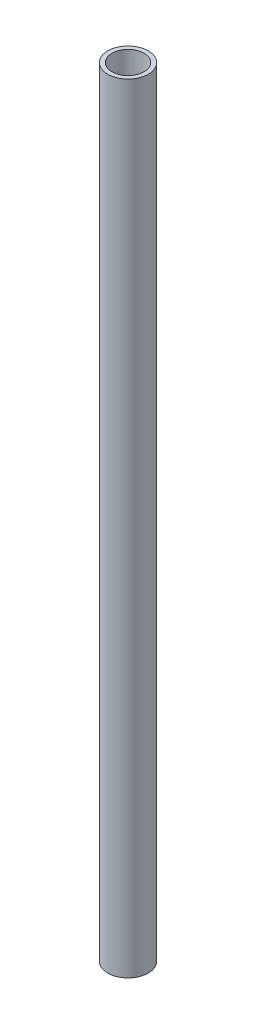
from build123d import *

# Parameters (mm, degrees)
SKETCH1_R           = 7.9375
SKETCH1_R_2         = 6.2865
BOSS_EXTRUDE1_DEPTH = 304.8


with BuildPart() as part:
    # Sketch1 → Boss-Extrude1 (new body)
    with BuildSketch(Plane(origin=(0, 0, 0), x_dir=(1, 0, 0), z_dir=(0, 1, 0))):
        with Locations(Location((0, 0, 0), (0, 0, 90))):
            Circle(SKETCH1_R)
        with Locations(Location((0, 0, 0), (0, 0, 90))):
            Circle(SKETCH1_R_2, mode=Mode.SUBTRACT)
    extrude(amount=BOSS_EXTRUDE1_DEPTH)


solid = part.part
